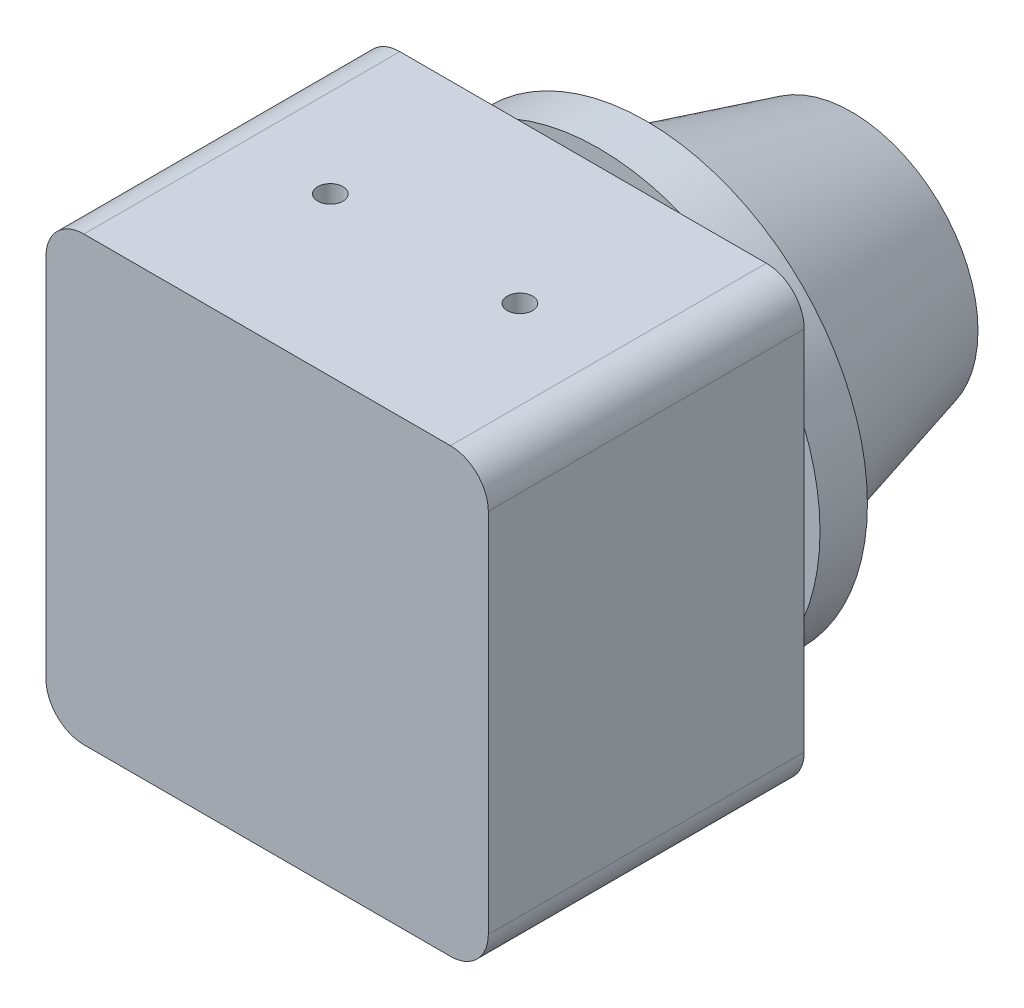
from build123d import *

# Parameters (mm, degrees)
EXTRUDE1_DEPTH     = 31.75
SKETCH4_R          = 1.27
CUT_EXTRUDE2_DEPTH = 171.890522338


with BuildPart() as part:
    # Sketch1 → Extrude1 (new body)
    with BuildSketch(Plane.XY):
        with BuildLine():
            Line((158.115, 149.225), (121.285, 149.225))
            ThreePointArc((121.285, 149.225), (118.590923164, 148.109076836), (117.475, 145.415))
            Line((117.475, 145.415), (117.475, 108.585))
            ThreePointArc((117.475, 108.585), (118.590923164, 105.890923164), (121.285, 104.775))
            Line((121.285, 104.775), (158.115, 104.775))
            ThreePointArc((158.115, 104.775), (160.809076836, 105.890923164), (161.925, 108.585))
            Line((161.925, 108.585), (161.925, 145.415))
            ThreePointArc((161.925, 145.415), (160.809076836, 148.109076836), (158.115, 149.225))
        make_face()
    extrude(amount=EXTRUDE1_DEPTH)

    # Sketch2 → Revolve1 (revolve)
    with BuildSketch(Plane(origin=(139.7, 0, 0), x_dir=(0, 0, -1), z_dir=(1, 0, 0)), mode=Mode.PRIVATE) as revolve1_sk:
        Polygon((0, 127), (0, 140.97), (1.5875, 140.97), (1.5875, 149.225), (6.35, 149.225), (6.35, 145.229801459), (26.9875, 139.7), (26.9875, 127), align=None)
    revolve(revolve1_sk.sketch.rotate(Axis((139.7, 127, 0), (0, 0, -1)), 90), axis=Axis((139.7, 127, 0), (0, 0, -1)))

    # Sketch4 → Cut-Extrude2 (cut, through all)
    with BuildSketch(Plane(origin=(0, 149.225, 0), x_dir=(-1, 0, 0), z_dir=(0, 1, 0))):
        with Locations((-130.175, 15.875)):
            Circle(SKETCH4_R)
        with Locations((-149.225, 15.875)):
            Circle(SKETCH4_R)
    extrude(amount=-CUT_EXTRUDE2_DEPTH, mode=Mode.SUBTRACT)


solid = part.part
